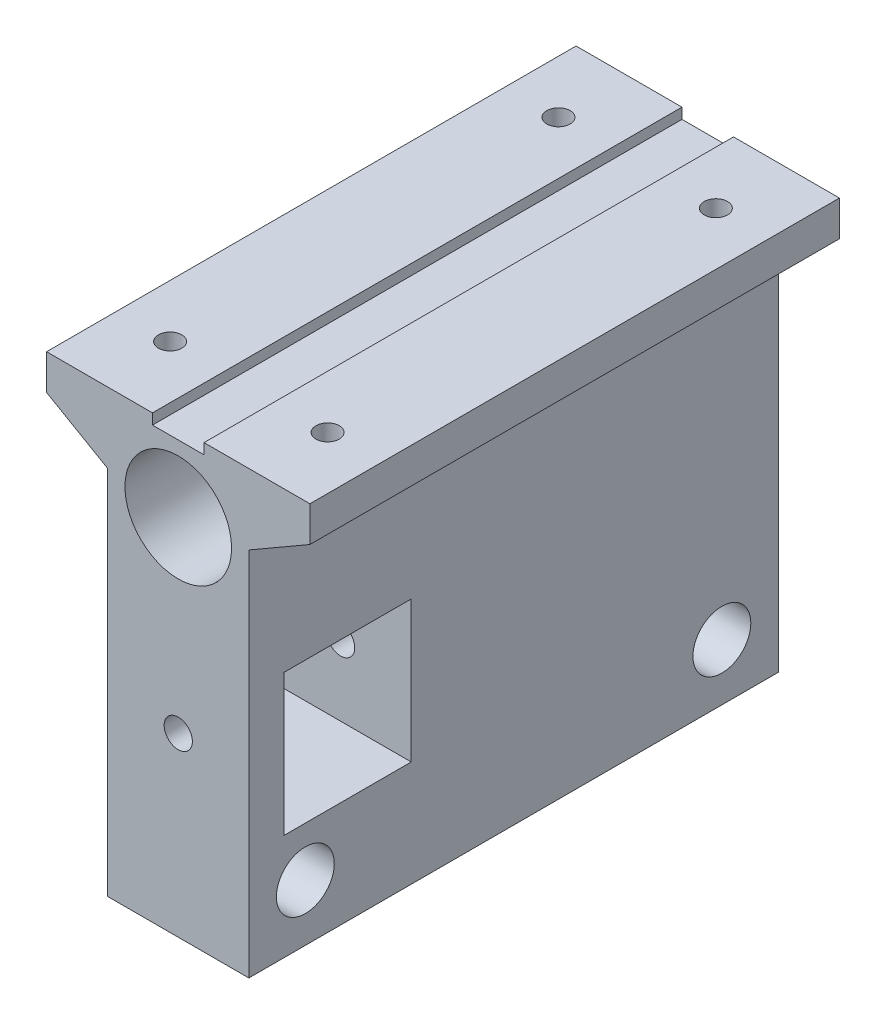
from build123d import *

# Parameters (mm, degrees)
CROQUIS1_R              = 7.55
SALIENTE_EXTRUIR1_DEPTH = 75
CROQUIS2_R              = 4.1
CORTAR_EXTRUIR1_DEPTH   = 10
CROQUIS3_W              = 18
CROQUIS3_H              = 20
CORTAR_EXTRUIR2_DEPTH   = 96.383816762
CROQUIS4_R              = 2
CORTAR_EXTRUIR3_DEPTH   = 28
CROQUIS5_R              = 1.65
CORTAR_EXTRUIR4_DEPTH   = 5


with BuildPart() as part:
    # Croquis1 → Saliente-Extruir1 (new body)
    with BuildSketch(Plane.XY):
        Polygon((-3.65, 11), (-3.65, 9.5), (3.65, 9.5), (3.65, 11), (18.65, 11), (18.65, 6), (10, 1.005920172), (10, -51.5), (-10, -51.5), (-10, 1.005920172), (-18.65, 6), (-18.65, 11), align=None)
        Circle(CROQUIS1_R, mode=Mode.SUBTRACT)
    extrude(amount=SALIENTE_EXTRUIR1_DEPTH)

    # Croquis2 → Cortar-Extruir1 (cut)
    with BuildSketch(Plane(origin=(10, 0, 0), x_dir=(0, 0, -1), z_dir=(1, 0, 0))):
        with Locations(Location((-8, -43.5, 0), (0, 0, 90))):
            Circle(CROQUIS2_R)
        with Locations(Location((-67, -43.5, 0), (0, 0, 90))):
            Circle(CROQUIS2_R)
    extrude(amount=-CORTAR_EXTRUIR1_DEPTH, mode=Mode.SUBTRACT)

    # Croquis3 → Cortar-Extruir2 (cut, through all)
    with BuildSketch(Plane(origin=(10, 0, 0), x_dir=(0, 0, -1), z_dir=(1, 0, 0))):
        with Locations((-61, -26.5)):
            Rectangle(CROQUIS3_W, CROQUIS3_H)
    extrude(amount=-CORTAR_EXTRUIR2_DEPTH, mode=Mode.SUBTRACT)

    # Croquis4 → Cortar-Extruir3 (cut)
    with BuildSketch(Plane.XY.offset(75)):
        with Locations((0, -26.5)):
            Circle(CROQUIS4_R)
    extrude(amount=-CORTAR_EXTRUIR3_DEPTH, mode=Mode.SUBTRACT)

    # Croquis5 → Cortar-Extruir4 (cut)
    with BuildSketch(Plane(origin=(0, 11, 0), x_dir=(1, 0, 0), z_dir=(0, 1, 0))):
        with Locations(Location((-11.15, -10, 0), (0, 0, 180))):
            Circle(CROQUIS5_R)
        with Locations(Location((11.15, -10, 0), (0, 0, 180))):
            Circle(CROQUIS5_R)
        with Locations(Location((-11.15, -65, 0), (0, 0, 180))):
            Circle(CROQUIS5_R)
        with Locations(Location((11.15, -65, 0), (0, 0, 180))):
            Circle(CROQUIS5_R)
    extrude(amount=-CORTAR_EXTRUIR4_DEPTH, mode=Mode.SUBTRACT)


solid = part.part
